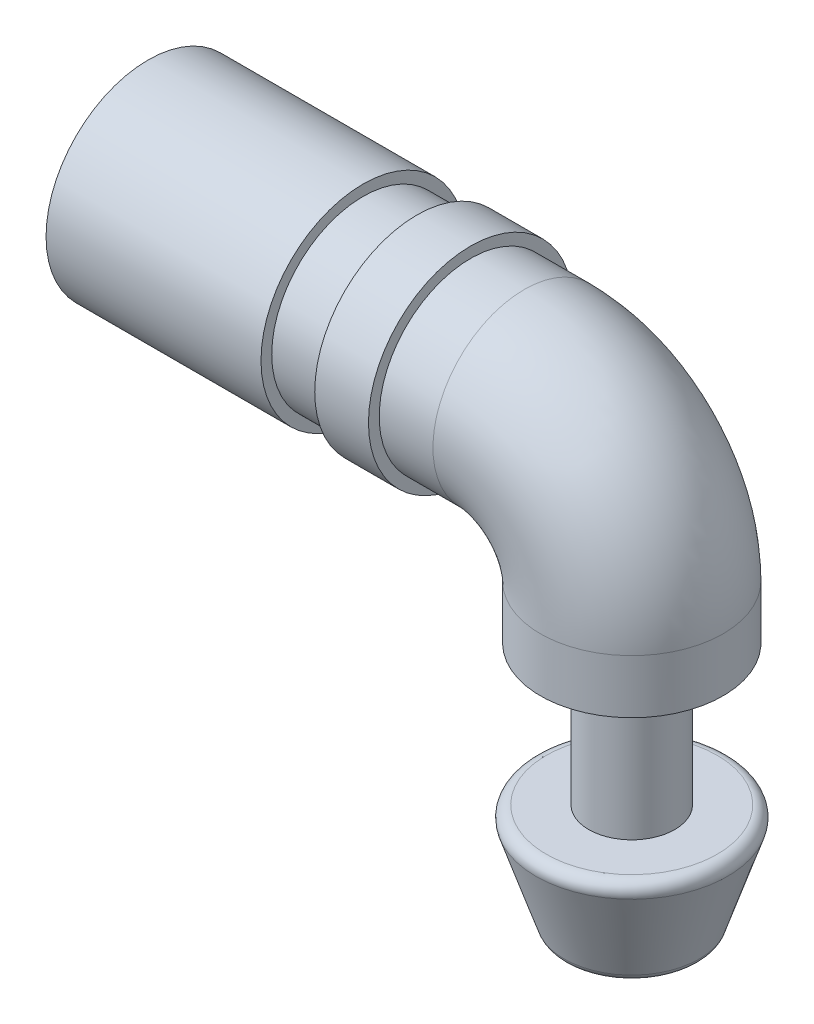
from build123d import *

# Parameters (mm, degrees)
CROQUIS3_R  = 8.5
REDONDEO1_R = 1


with BuildPart() as part:
    # Croquis1 → Revoluci_n1 (revolve)
    with BuildSketch(Plane.XY, mode=Mode.PRIVATE) as revoluci_n1_sk:
        Polygon((0, 0), (0, 9.5), (20, 9.5), (20, 8.5), (25, 8.5), (25, 9.5), (30, 9.5), (30, 0), align=None)
    revolve(revoluci_n1_sk.sketch.rotate(Axis((0, 0, 0), (1, 0, 0)), 90), axis=Axis((0, 0, 0), (1, 0, 0)))

    # Barrer1: sweep along a path in Croquis2
    with BuildLine(Plane.XY.offset(8.5)) as barrer1_path:
        Line((30, 0), (35, 0))
        ThreePointArc((35, 0), (42.071067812, -2.928932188), (45, -10))
        Line((45, -10), (45, -15.002946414))
    # Croquis3 → Barrer1 (sweep)
    with BuildSketch(Plane(origin=(30, 0, 0), x_dir=(0, 0, -1), z_dir=(1, 0, 0))):
        Circle(CROQUIS3_R)
    sweep(path=barrer1_path.line)

    # Croquis4 → Revoluci_n2 (revolve)
    with BuildSketch(Plane.XY, mode=Mode.PRIVATE) as revoluci_n2_sk:
        Polygon((45, -15.002946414), (49, -15.002946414), (49, -28.027084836), (54.349191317, -28.027084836), (51.047957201, -38.002946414), (45, -38.002946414), align=None)
    revolve(revoluci_n2_sk.sketch.rotate(Axis((45, -15.002946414, 0), (0, -1, 0)), 90), axis=Axis((45, -15.002946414, 0), (0, -1, 0)))

    # Redondeo1
    redondeo1_edges = [part.edges().sort_by_distance(p)[0] for p in [
        (45, -28.027084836, -9.349191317),
        (45, -38.002946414, -6.047957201),
    ]]
    fillet(redondeo1_edges, radius=REDONDEO1_R)


solid = part.part
